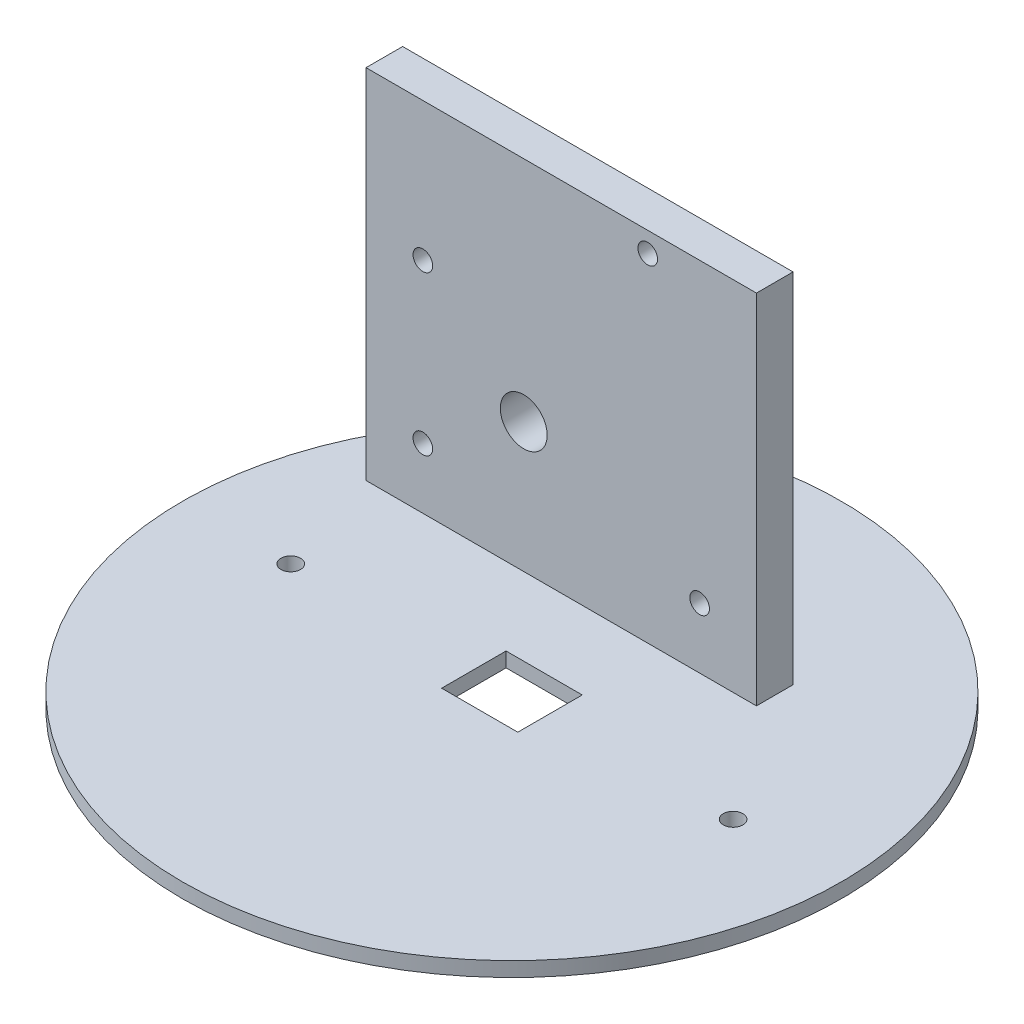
ISO-10303-21;
HEADER;
FILE_DESCRIPTION(('STEP AP214'),'2;1');
FILE_NAME('part.step','',(''),(''),'','','');
FILE_SCHEMA(('AUTOMOTIVE_DESIGN { 1 0 10303 214 1 1 1 1 }'));
ENDSEC;
DATA;
#1=APPLICATION_CONTEXT('core data for automotive mechanical design processes');
#2=APPLICATION_PROTOCOL_DEFINITION('international standard','automotive_design',2000,#1);
#3=PRODUCT_CONTEXT('',#1,'mechanical');
#4=PRODUCT('Part','Part','',(#3));
#5=PRODUCT_RELATED_PRODUCT_CATEGORY('part','',(#4));
#6=PRODUCT_DEFINITION_FORMATION('','',#4);
#7=PRODUCT_DEFINITION_CONTEXT('part definition',#1,'design');
#8=PRODUCT_DEFINITION('design','',#6,#7);
#9=PRODUCT_DEFINITION_SHAPE('','',#8);
#10=(LENGTH_UNIT() NAMED_UNIT(*) SI_UNIT(.MILLI.,.METRE.));
#11=(NAMED_UNIT(*) PLANE_ANGLE_UNIT() SI_UNIT($,.RADIAN.));
#12=(NAMED_UNIT(*) SI_UNIT($,.STERADIAN.) SOLID_ANGLE_UNIT());
#13=UNCERTAINTY_MEASURE_WITH_UNIT(LENGTH_MEASURE(1.E-05),#10,'distance_accuracy_value','');
#14=(GEOMETRIC_REPRESENTATION_CONTEXT(3) GLOBAL_UNCERTAINTY_ASSIGNED_CONTEXT((#13)) GLOBAL_UNIT_ASSIGNED_CONTEXT((#10,
#11,#12)) REPRESENTATION_CONTEXT('',''));
#15=CARTESIAN_POINT('',(0.,0.,0.));
#16=DIRECTION('',(0.,0.,1.));
#17=DIRECTION('',(1.,0.,0.));
#18=AXIS2_PLACEMENT_3D('',#15,#16,#17);
#19=CARTESIAN_POINT('',(-44.349924,64.53886,-19.05));
#20=DIRECTION('',(0.,0.,-1.));
#21=DIRECTION('',(-1.,0.,0.));
#22=AXIS2_PLACEMENT_3D('',#19,#20,#21);
#23=PLANE('',#22);
#24=CARTESIAN_POINT('',(-34.49992338,13.040000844,-19.05));
#25=DIRECTION('',(0.,0.,1.));
#26=DIRECTION('',(1.,0.,0.));
#27=AXIS2_PLACEMENT_3D('',#24,#25,#26);
#28=CIRCLE('',#27,1.69999999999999);
#29=CARTESIAN_POINT('',(-32.79992338,13.040000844,-19.05));
#30=VERTEX_POINT('',#29);
#31=EDGE_CURVE('E293',#30,#30,#28,.T.);
#32=ORIENTED_EDGE('',*,*,#31,.F.);
#33=EDGE_LOOP('',(#32));
#34=FACE_BOUND('',#33,.T.);
#35=CARTESIAN_POINT('',(-34.49992338,40.539996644,-19.05));
#36=DIRECTION('',(0.,0.,1.));
#37=DIRECTION('',(1.,0.,0.));
#38=AXIS2_PLACEMENT_3D('',#35,#36,#37);
#39=CIRCLE('',#38,1.69999999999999);
#40=CARTESIAN_POINT('',(-32.79992338,40.539996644,-19.05));
#41=VERTEX_POINT('',#40);
#42=EDGE_CURVE('E284',#41,#41,#39,.T.);
#43=ORIENTED_EDGE('',*,*,#42,.F.);
#44=EDGE_LOOP('',(#43));
#45=FACE_BOUND('',#44,.T.);
#46=CARTESIAN_POINT('',(13.49996538,13.040000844,-19.05));
#47=DIRECTION('',(0.,0.,1.));
#48=DIRECTION('',(1.,0.,0.));
#49=AXIS2_PLACEMENT_3D('',#46,#47,#48);
#50=CIRCLE('',#49,1.69999999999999);
#51=CARTESIAN_POINT('',(15.19996538,13.040000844,-19.05));
#52=VERTEX_POINT('',#51);
#53=EDGE_CURVE('E266',#52,#52,#50,.T.);
#54=ORIENTED_EDGE('',*,*,#53,.F.);
#55=EDGE_LOOP('',(#54));
#56=FACE_BOUND('',#55,.T.);
#57=CARTESIAN_POINT('',(-16.999966,25.04000072,-19.05));
#58=DIRECTION('',(0.,0.,-1.));
#59=DIRECTION('',(-1.,0.,0.));
#60=AXIS2_PLACEMENT_3D('',#57,#58,#59);
#61=CIRCLE('',#60,4.064);
#62=CARTESIAN_POINT('',(-21.063966,25.04000072,-19.05));
#63=VERTEX_POINT('',#62);
#64=EDGE_CURVE('E43',#63,#63,#61,.T.);
#65=ORIENTED_EDGE('',*,*,#64,.T.);
#66=EDGE_LOOP('',(#65));
#67=FACE_BOUND('',#66,.T.);
#68=DIRECTION('',(1.,0.,0.));
#69=VECTOR('',#68,1.);
#70=CARTESIAN_POINT('',(-44.349924,2.54,-19.05));
#71=LINE('',#70,#69);
#72=CARTESIAN_POINT('',(-44.349924,2.54,-19.05));
#73=VERTEX_POINT('',#72);
#74=CARTESIAN_POINT('',(23.349966,2.54,-19.05));
#75=VERTEX_POINT('',#74);
#76=EDGE_CURVE('E125',#73,#75,#71,.T.);
#77=ORIENTED_EDGE('',*,*,#76,.T.);
#78=DIRECTION('',(0.,-1.,0.));
#79=VECTOR('',#78,1.);
#80=CARTESIAN_POINT('',(23.349966,64.53886,-19.05));
#81=LINE('',#80,#79);
#82=CARTESIAN_POINT('',(23.349966,64.53886,-19.05));
#83=VERTEX_POINT('',#82);
#84=EDGE_CURVE('E241',#83,#75,#81,.T.);
#85=ORIENTED_EDGE('',*,*,#84,.F.);
#86=DIRECTION('',(1.,0.,0.));
#87=VECTOR('',#86,1.);
#88=CARTESIAN_POINT('',(-44.349924,64.53886,-19.05));
#89=LINE('',#88,#87);
#90=CARTESIAN_POINT('',(-44.349924,64.53886,-19.05));
#91=VERTEX_POINT('',#90);
#92=EDGE_CURVE('E121',#91,#83,#89,.T.);
#93=ORIENTED_EDGE('',*,*,#92,.F.);
#94=DIRECTION('',(0.,-1.,0.));
#95=VECTOR('',#94,1.);
#96=CARTESIAN_POINT('',(-44.349924,64.53886,-19.05));
#97=LINE('',#96,#95);
#98=EDGE_CURVE('E56',#91,#73,#97,.T.);
#99=ORIENTED_EDGE('',*,*,#98,.T.);
#100=EDGE_LOOP('',(#77,#85,#93,#99));
#101=FACE_BOUND('',#100,.T.);
#102=CARTESIAN_POINT('',(4.4999656,61.03885938,-19.05));
#103=DIRECTION('',(0.,0.,1.));
#104=DIRECTION('',(1.,0.,0.));
#105=AXIS2_PLACEMENT_3D('',#102,#103,#104);
#106=CIRCLE('',#105,1.69999999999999);
#107=CARTESIAN_POINT('',(6.19996559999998,61.03885938,-19.05));
#108=VERTEX_POINT('',#107);
#109=EDGE_CURVE('E275',#108,#108,#106,.T.);
#110=ORIENTED_EDGE('',*,*,#109,.F.);
#111=EDGE_LOOP('',(#110));
#112=FACE_BOUND('',#111,.T.);
#113=ADVANCED_FACE('F39',(#34,#45,#56,#67,#101,#112),#23,.F.);
#114=CARTESIAN_POINT('',(0.,2.54,0.));
#115=DIRECTION('',(0.,1.,0.));
#116=DIRECTION('',(0.,0.,1.));
#117=AXIS2_PLACEMENT_3D('',#114,#115,#116);
#118=PLANE('',#117);
#119=CARTESIAN_POINT('',(38.354,2.54,0.));
#120=DIRECTION('',(0.,1.,0.));
#121=DIRECTION('',(0.,0.,1.));
#122=AXIS2_PLACEMENT_3D('',#119,#120,#121);
#123=CIRCLE('',#122,1.7);
#124=CARTESIAN_POINT('',(38.354,2.54,1.69999999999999));
#125=VERTEX_POINT('',#124);
#126=EDGE_CURVE('E255',#125,#125,#123,.T.);
#127=ORIENTED_EDGE('',*,*,#126,.F.);
#128=EDGE_LOOP('',(#127));
#129=FACE_BOUND('',#128,.T.);
#130=CARTESIAN_POINT('',(-38.354,2.54,0.));
#131=DIRECTION('',(0.,1.,0.));
#132=DIRECTION('',(0.,0.,1.));
#133=AXIS2_PLACEMENT_3D('',#130,#131,#132);
#134=CIRCLE('',#133,1.7);
#135=CARTESIAN_POINT('',(-38.354,2.54,1.7));
#136=VERTEX_POINT('',#135);
#137=EDGE_CURVE('E246',#136,#136,#134,.T.);
#138=ORIENTED_EDGE('',*,*,#137,.F.);
#139=EDGE_LOOP('',(#138));
#140=FACE_BOUND('',#139,.T.);
#141=DIRECTION('',(0.,0.,-1.));
#142=VECTOR('',#141,1.);
#143=CARTESIAN_POINT('',(6.604,2.54,-5.588));
#144=LINE('',#143,#142);
#145=CARTESIAN_POINT('',(6.604,2.54,5.588));
#146=VERTEX_POINT('',#145);
#147=CARTESIAN_POINT('',(6.604,2.54,-5.588));
#148=VERTEX_POINT('',#147);
#149=EDGE_CURVE('E64',#146,#148,#144,.T.);
#150=ORIENTED_EDGE('',*,*,#149,.F.);
#151=DIRECTION('',(1.,0.,0.));
#152=VECTOR('',#151,1.);
#153=CARTESIAN_POINT('',(-6.604,2.54,5.588));
#154=LINE('',#153,#152);
#155=CARTESIAN_POINT('',(-6.604,2.54,5.588));
#156=VERTEX_POINT('',#155);
#157=EDGE_CURVE('E141',#156,#146,#154,.T.);
#158=ORIENTED_EDGE('',*,*,#157,.F.);
#159=DIRECTION('',(0.,0.,1.));
#160=VECTOR('',#159,1.);
#161=CARTESIAN_POINT('',(-6.604,2.54,-5.588));
#162=LINE('',#161,#160);
#163=CARTESIAN_POINT('',(-6.604,2.54,-5.588));
#164=VERTEX_POINT('',#163);
#165=EDGE_CURVE('E153',#164,#156,#162,.T.);
#166=ORIENTED_EDGE('',*,*,#165,.F.);
#167=DIRECTION('',(-1.,0.,0.));
#168=VECTOR('',#167,1.);
#169=CARTESIAN_POINT('',(-6.604,2.54,-5.588));
#170=LINE('',#169,#168);
#171=EDGE_CURVE('E132',#148,#164,#170,.T.);
#172=ORIENTED_EDGE('',*,*,#171,.F.);
#173=EDGE_LOOP('',(#150,#158,#166,#172));
#174=FACE_BOUND('',#173,.T.);
#175=CARTESIAN_POINT('',(0.,2.54,0.));
#176=DIRECTION('',(0.,1.,0.));
#177=DIRECTION('',(0.,0.,1.));
#178=AXIS2_PLACEMENT_3D('',#175,#176,#177);
#179=CIRCLE('',#178,57.15);
#180=CARTESIAN_POINT('',(0.,2.54,57.15));
#181=VERTEX_POINT('',#180);
#182=EDGE_CURVE('E11',#181,#181,#179,.T.);
#183=ORIENTED_EDGE('',*,*,#182,.T.);
#184=EDGE_LOOP('',(#183));
#185=FACE_BOUND('',#184,.T.);
#186=DIRECTION('',(-1.,0.,0.));
#187=VECTOR('',#186,1.);
#188=CARTESIAN_POINT('',(-44.349924,2.54,-25.4));
#189=LINE('',#188,#187);
#190=CARTESIAN_POINT('',(23.349966,2.54,-25.4));
#191=VERTEX_POINT('',#190);
#192=CARTESIAN_POINT('',(-44.349924,2.54,-25.4));
#193=VERTEX_POINT('',#192);
#194=EDGE_CURVE('E231',#191,#193,#189,.T.);
#195=ORIENTED_EDGE('',*,*,#194,.F.);
#196=DIRECTION('',(0.,0.,-1.));
#197=VECTOR('',#196,1.);
#198=CARTESIAN_POINT('',(23.349966,2.54,-25.4));
#199=LINE('',#198,#197);
#200=EDGE_CURVE('E129',#75,#191,#199,.T.);
#201=ORIENTED_EDGE('',*,*,#200,.F.);
#202=ORIENTED_EDGE('',*,*,#76,.F.);
#203=DIRECTION('',(0.,0.,1.));
#204=VECTOR('',#203,1.);
#205=CARTESIAN_POINT('',(-44.349924,2.54,-25.4));
#206=LINE('',#205,#204);
#207=EDGE_CURVE('E233',#193,#73,#206,.T.);
#208=ORIENTED_EDGE('',*,*,#207,.F.);
#209=EDGE_LOOP('',(#195,#201,#202,#208));
#210=FACE_BOUND('',#209,.T.);
#211=ADVANCED_FACE('F180',(#129,#140,#174,#185,#210),#118,.T.);
#212=CARTESIAN_POINT('',(0.,2.54,0.));
#213=DIRECTION('',(0.,-1.,0.));
#214=DIRECTION('',(0.,0.,-1.));
#215=AXIS2_PLACEMENT_3D('',#212,#213,#214);
#216=CYLINDRICAL_SURFACE('',#215,57.15);
#217=ORIENTED_EDGE('',*,*,#182,.F.);
#218=EDGE_LOOP('',(#217));
#219=FACE_BOUND('',#218,.T.);
#220=CARTESIAN_POINT('',(0.,0.,0.));
#221=DIRECTION('',(0.,1.,0.));
#222=DIRECTION('',(0.,0.,1.));
#223=AXIS2_PLACEMENT_3D('',#220,#221,#222);
#224=CIRCLE('',#223,57.15);
#225=CARTESIAN_POINT('',(0.,0.,57.15));
#226=VERTEX_POINT('',#225);
#227=EDGE_CURVE('E48',#226,#226,#224,.T.);
#228=ORIENTED_EDGE('',*,*,#227,.T.);
#229=EDGE_LOOP('',(#228));
#230=FACE_BOUND('',#229,.T.);
#231=ADVANCED_FACE('F41',(#219,#230),#216,.T.);
#232=CARTESIAN_POINT('',(0.,0.,0.));
#233=DIRECTION('',(0.,1.,0.));
#234=DIRECTION('',(0.,0.,1.));
#235=AXIS2_PLACEMENT_3D('',#232,#233,#234);
#236=PLANE('',#235);
#237=CARTESIAN_POINT('',(38.354,0.,0.));
#238=DIRECTION('',(0.,1.,0.));
#239=DIRECTION('',(0.,0.,1.));
#240=AXIS2_PLACEMENT_3D('',#237,#238,#239);
#241=CIRCLE('',#240,1.725);
#242=CARTESIAN_POINT('',(38.354,0.,1.72499999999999));
#243=VERTEX_POINT('',#242);
#244=EDGE_CURVE('E258',#243,#243,#241,.T.);
#245=ORIENTED_EDGE('',*,*,#244,.T.);
#246=EDGE_LOOP('',(#245));
#247=FACE_BOUND('',#246,.T.);
#248=CARTESIAN_POINT('',(-38.354,0.,0.));
#249=DIRECTION('',(0.,1.,0.));
#250=DIRECTION('',(0.,0.,1.));
#251=AXIS2_PLACEMENT_3D('',#248,#249,#250);
#252=CIRCLE('',#251,1.725);
#253=CARTESIAN_POINT('',(-38.354,0.,1.725));
#254=VERTEX_POINT('',#253);
#255=EDGE_CURVE('E249',#254,#254,#252,.T.);
#256=ORIENTED_EDGE('',*,*,#255,.T.);
#257=EDGE_LOOP('',(#256));
#258=FACE_BOUND('',#257,.T.);
#259=DIRECTION('',(1.,0.,0.));
#260=VECTOR('',#259,1.);
#261=CARTESIAN_POINT('',(-6.604,0.,5.588));
#262=LINE('',#261,#260);
#263=CARTESIAN_POINT('',(-6.604,0.,5.588));
#264=VERTEX_POINT('',#263);
#265=CARTESIAN_POINT('',(6.604,0.,5.588));
#266=VERTEX_POINT('',#265);
#267=EDGE_CURVE('E147',#264,#266,#262,.T.);
#268=ORIENTED_EDGE('',*,*,#267,.T.);
#269=DIRECTION('',(0.,0.,-1.));
#270=VECTOR('',#269,1.);
#271=CARTESIAN_POINT('',(6.604,0.,-5.588));
#272=LINE('',#271,#270);
#273=CARTESIAN_POINT('',(6.604,0.,-5.588));
#274=VERTEX_POINT('',#273);
#275=EDGE_CURVE('E137',#266,#274,#272,.T.);
#276=ORIENTED_EDGE('',*,*,#275,.T.);
#277=DIRECTION('',(-1.,0.,0.));
#278=VECTOR('',#277,1.);
#279=CARTESIAN_POINT('',(-6.604,0.,-5.588));
#280=LINE('',#279,#278);
#281=CARTESIAN_POINT('',(-6.604,0.,-5.588));
#282=VERTEX_POINT('',#281);
#283=EDGE_CURVE('E140',#274,#282,#280,.T.);
#284=ORIENTED_EDGE('',*,*,#283,.T.);
#285=DIRECTION('',(0.,0.,1.));
#286=VECTOR('',#285,1.);
#287=CARTESIAN_POINT('',(-6.604,0.,-5.588));
#288=LINE('',#287,#286);
#289=EDGE_CURVE('E144',#282,#264,#288,.T.);
#290=ORIENTED_EDGE('',*,*,#289,.T.);
#291=EDGE_LOOP('',(#268,#276,#284,#290));
#292=FACE_BOUND('',#291,.T.);
#293=ORIENTED_EDGE('',*,*,#227,.F.);
#294=EDGE_LOOP('',(#293));
#295=FACE_BOUND('',#294,.T.);
#296=ADVANCED_FACE('F168',(#247,#258,#292,#295),#236,.F.);
#297=CARTESIAN_POINT('',(6.604,0.,-5.588));
#298=DIRECTION('',(1.,0.,0.));
#299=DIRECTION('',(0.,0.,-1.));
#300=AXIS2_PLACEMENT_3D('',#297,#298,#299);
#301=PLANE('',#300);
#302=ORIENTED_EDGE('',*,*,#149,.T.);
#303=DIRECTION('',(0.,1.,0.));
#304=VECTOR('',#303,1.);
#305=CARTESIAN_POINT('',(6.604,0.,-5.588));
#306=LINE('',#305,#304);
#307=EDGE_CURVE('E149',#274,#148,#306,.T.);
#308=ORIENTED_EDGE('',*,*,#307,.F.);
#309=ORIENTED_EDGE('',*,*,#275,.F.);
#310=DIRECTION('',(0.,1.,0.));
#311=VECTOR('',#310,1.);
#312=CARTESIAN_POINT('',(6.604,0.,5.588));
#313=LINE('',#312,#311);
#314=EDGE_CURVE('E158',#266,#146,#313,.T.);
#315=ORIENTED_EDGE('',*,*,#314,.T.);
#316=EDGE_LOOP('',(#302,#308,#309,#315));
#317=FACE_BOUND('',#316,.T.);
#318=ADVANCED_FACE('F170',(#317),#301,.F.);
#319=CARTESIAN_POINT('',(-6.604,0.,5.588));
#320=DIRECTION('',(0.,0.,1.));
#321=DIRECTION('',(1.,0.,0.));
#322=AXIS2_PLACEMENT_3D('',#319,#320,#321);
#323=PLANE('',#322);
#324=ORIENTED_EDGE('',*,*,#157,.T.);
#325=ORIENTED_EDGE('',*,*,#314,.F.);
#326=ORIENTED_EDGE('',*,*,#267,.F.);
#327=DIRECTION('',(0.,1.,0.));
#328=VECTOR('',#327,1.);
#329=CARTESIAN_POINT('',(-6.604,0.,5.588));
#330=LINE('',#329,#328);
#331=EDGE_CURVE('E160',#264,#156,#330,.T.);
#332=ORIENTED_EDGE('',*,*,#331,.T.);
#333=EDGE_LOOP('',(#324,#325,#326,#332));
#334=FACE_BOUND('',#333,.T.);
#335=ADVANCED_FACE('F177',(#334),#323,.F.);
#336=CARTESIAN_POINT('',(-6.604,0.,-5.588));
#337=DIRECTION('',(-1.,0.,0.));
#338=DIRECTION('',(0.,0.,1.));
#339=AXIS2_PLACEMENT_3D('',#336,#337,#338);
#340=PLANE('',#339);
#341=ORIENTED_EDGE('',*,*,#165,.T.);
#342=ORIENTED_EDGE('',*,*,#331,.F.);
#343=ORIENTED_EDGE('',*,*,#289,.F.);
#344=DIRECTION('',(0.,1.,0.));
#345=VECTOR('',#344,1.);
#346=CARTESIAN_POINT('',(-6.604,0.,-5.588));
#347=LINE('',#346,#345);
#348=EDGE_CURVE('E162',#282,#164,#347,.T.);
#349=ORIENTED_EDGE('',*,*,#348,.T.);
#350=EDGE_LOOP('',(#341,#342,#343,#349));
#351=FACE_BOUND('',#350,.T.);
#352=ADVANCED_FACE('F209',(#351),#340,.F.);
#353=CARTESIAN_POINT('',(-6.604,0.,-5.588));
#354=DIRECTION('',(0.,0.,-1.));
#355=DIRECTION('',(-1.,0.,0.));
#356=AXIS2_PLACEMENT_3D('',#353,#354,#355);
#357=PLANE('',#356);
#358=ORIENTED_EDGE('',*,*,#171,.T.);
#359=ORIENTED_EDGE('',*,*,#348,.F.);
#360=ORIENTED_EDGE('',*,*,#283,.F.);
#361=ORIENTED_EDGE('',*,*,#307,.T.);
#362=EDGE_LOOP('',(#358,#359,#360,#361));
#363=FACE_BOUND('',#362,.T.);
#364=ADVANCED_FACE('F206',(#363),#357,.F.);
#365=CARTESIAN_POINT('',(23.349966,64.53886,-25.4));
#366=DIRECTION('',(-1.,0.,0.));
#367=DIRECTION('',(0.,0.,1.));
#368=AXIS2_PLACEMENT_3D('',#365,#366,#367);
#369=PLANE('',#368);
#370=ORIENTED_EDGE('',*,*,#200,.T.);
#371=DIRECTION('',(0.,-1.,0.));
#372=VECTOR('',#371,1.);
#373=CARTESIAN_POINT('',(23.349966,64.53886,-25.4));
#374=LINE('',#373,#372);
#375=CARTESIAN_POINT('',(23.349966,64.53886,-25.4));
#376=VERTEX_POINT('',#375);
#377=EDGE_CURVE('E110',#376,#191,#374,.T.);
#378=ORIENTED_EDGE('',*,*,#377,.F.);
#379=DIRECTION('',(0.,0.,-1.));
#380=VECTOR('',#379,1.);
#381=CARTESIAN_POINT('',(23.349966,64.53886,-25.4));
#382=LINE('',#381,#380);
#383=EDGE_CURVE('E117',#83,#376,#382,.T.);
#384=ORIENTED_EDGE('',*,*,#383,.F.);
#385=ORIENTED_EDGE('',*,*,#84,.T.);
#386=EDGE_LOOP('',(#370,#378,#384,#385));
#387=FACE_BOUND('',#386,.T.);
#388=ADVANCED_FACE('F127',(#387),#369,.F.);
#389=CARTESIAN_POINT('',(-44.349924,64.53886,-25.4));
#390=DIRECTION('',(0.,0.,1.));
#391=DIRECTION('',(1.,0.,0.));
#392=AXIS2_PLACEMENT_3D('',#389,#390,#391);
#393=PLANE('',#392);
#394=CARTESIAN_POINT('',(-34.49992338,13.040000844,-25.4));
#395=DIRECTION('',(0.,0.,1.));
#396=DIRECTION('',(1.,0.,0.));
#397=AXIS2_PLACEMENT_3D('',#394,#395,#396);
#398=CIRCLE('',#397,1.725);
#399=CARTESIAN_POINT('',(-32.77492338,13.040000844,-25.4));
#400=VERTEX_POINT('',#399);
#401=EDGE_CURVE('E296',#400,#400,#398,.T.);
#402=ORIENTED_EDGE('',*,*,#401,.T.);
#403=EDGE_LOOP('',(#402));
#404=FACE_BOUND('',#403,.T.);
#405=CARTESIAN_POINT('',(-34.49992338,40.539996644,-25.4));
#406=DIRECTION('',(0.,0.,1.));
#407=DIRECTION('',(1.,0.,0.));
#408=AXIS2_PLACEMENT_3D('',#405,#406,#407);
#409=CIRCLE('',#408,1.725);
#410=CARTESIAN_POINT('',(-32.77492338,40.539996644,-25.4));
#411=VERTEX_POINT('',#410);
#412=EDGE_CURVE('E287',#411,#411,#409,.T.);
#413=ORIENTED_EDGE('',*,*,#412,.T.);
#414=EDGE_LOOP('',(#413));
#415=FACE_BOUND('',#414,.T.);
#416=CARTESIAN_POINT('',(4.4999656,61.03885938,-25.4));
#417=DIRECTION('',(0.,0.,1.));
#418=DIRECTION('',(1.,0.,0.));
#419=AXIS2_PLACEMENT_3D('',#416,#417,#418);
#420=CIRCLE('',#419,1.725);
#421=CARTESIAN_POINT('',(6.22496559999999,61.03885938,-25.4));
#422=VERTEX_POINT('',#421);
#423=EDGE_CURVE('E278',#422,#422,#420,.T.);
#424=ORIENTED_EDGE('',*,*,#423,.T.);
#425=EDGE_LOOP('',(#424));
#426=FACE_BOUND('',#425,.T.);
#427=CARTESIAN_POINT('',(13.49996538,13.040000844,-25.4));
#428=DIRECTION('',(0.,0.,1.));
#429=DIRECTION('',(1.,0.,0.));
#430=AXIS2_PLACEMENT_3D('',#427,#428,#429);
#431=CIRCLE('',#430,1.725);
#432=CARTESIAN_POINT('',(15.22496538,13.040000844,-25.4));
#433=VERTEX_POINT('',#432);
#434=EDGE_CURVE('E269',#433,#433,#431,.T.);
#435=ORIENTED_EDGE('',*,*,#434,.T.);
#436=EDGE_LOOP('',(#435));
#437=FACE_BOUND('',#436,.T.);
#438=CARTESIAN_POINT('',(-16.999966,25.04000072,-25.4));
#439=DIRECTION('',(0.,0.,-1.));
#440=DIRECTION('',(-1.,0.,0.));
#441=AXIS2_PLACEMENT_3D('',#438,#439,#440);
#442=CIRCLE('',#441,4.064);
#443=CARTESIAN_POINT('',(-21.063966,25.04000072,-25.4));
#444=VERTEX_POINT('',#443);
#445=EDGE_CURVE('E260',#444,#444,#442,.T.);
#446=ORIENTED_EDGE('',*,*,#445,.F.);
#447=EDGE_LOOP('',(#446));
#448=FACE_BOUND('',#447,.T.);
#449=ORIENTED_EDGE('',*,*,#194,.T.);
#450=DIRECTION('',(0.,-1.,0.));
#451=VECTOR('',#450,1.);
#452=CARTESIAN_POINT('',(-44.349924,64.53886,-25.4));
#453=LINE('',#452,#451);
#454=CARTESIAN_POINT('',(-44.349924,64.53886,-25.4));
#455=VERTEX_POINT('',#454);
#456=EDGE_CURVE('E113',#455,#193,#453,.T.);
#457=ORIENTED_EDGE('',*,*,#456,.F.);
#458=DIRECTION('',(-1.,0.,0.));
#459=VECTOR('',#458,1.);
#460=CARTESIAN_POINT('',(-44.349924,64.53886,-25.4));
#461=LINE('',#460,#459);
#462=EDGE_CURVE('E106',#376,#455,#461,.T.);
#463=ORIENTED_EDGE('',*,*,#462,.F.);
#464=ORIENTED_EDGE('',*,*,#377,.T.);
#465=EDGE_LOOP('',(#449,#457,#463,#464));
#466=FACE_BOUND('',#465,.T.);
#467=ADVANCED_FACE('F108',(#404,#415,#426,#437,#448,#466),#393,.F.);
#468=CARTESIAN_POINT('',(-44.349924,64.53886,-25.4));
#469=DIRECTION('',(1.,0.,0.));
#470=DIRECTION('',(0.,0.,-1.));
#471=AXIS2_PLACEMENT_3D('',#468,#469,#470);
#472=PLANE('',#471);
#473=ORIENTED_EDGE('',*,*,#207,.T.);
#474=ORIENTED_EDGE('',*,*,#98,.F.);
#475=DIRECTION('',(0.,0.,1.));
#476=VECTOR('',#475,1.);
#477=CARTESIAN_POINT('',(-44.349924,64.53886,-25.4));
#478=LINE('',#477,#476);
#479=EDGE_CURVE('E116',#455,#91,#478,.T.);
#480=ORIENTED_EDGE('',*,*,#479,.F.);
#481=ORIENTED_EDGE('',*,*,#456,.T.);
#482=EDGE_LOOP('',(#473,#474,#480,#481));
#483=FACE_BOUND('',#482,.T.);
#484=ADVANCED_FACE('F198',(#483),#472,.F.);
#485=CARTESIAN_POINT('',(0.,64.53886,0.));
#486=DIRECTION('',(0.,1.,0.));
#487=DIRECTION('',(0.,0.,1.));
#488=AXIS2_PLACEMENT_3D('',#485,#486,#487);
#489=PLANE('',#488);
#490=ORIENTED_EDGE('',*,*,#383,.T.);
#491=ORIENTED_EDGE('',*,*,#462,.T.);
#492=ORIENTED_EDGE('',*,*,#479,.T.);
#493=ORIENTED_EDGE('',*,*,#92,.T.);
#494=EDGE_LOOP('',(#490,#491,#492,#493));
#495=FACE_BOUND('',#494,.T.);
#496=ADVANCED_FACE('F120',(#495),#489,.T.);
#497=CARTESIAN_POINT('',(-38.354,0.0250000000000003,0.));
#498=DIRECTION('',(0.,-1.,0.));
#499=DIRECTION('',(0.,0.,-1.));
#500=AXIS2_PLACEMENT_3D('',#497,#498,#499);
#501=CONICAL_SURFACE('',#500,1.7,0.785398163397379);
#502=ORIENTED_EDGE('',*,*,#255,.F.);
#503=EDGE_LOOP('',(#502));
#504=FACE_BOUND('',#503,.T.);
#505=CARTESIAN_POINT('',(-38.354,0.0250000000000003,0.));
#506=DIRECTION('',(0.,1.,0.));
#507=DIRECTION('',(0.,0.,1.));
#508=AXIS2_PLACEMENT_3D('',#505,#506,#507);
#509=CIRCLE('',#508,1.7);
#510=CARTESIAN_POINT('',(-38.354,0.0250000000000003,1.7));
#511=VERTEX_POINT('',#510);
#512=EDGE_CURVE('E236',#511,#511,#509,.T.);
#513=ORIENTED_EDGE('',*,*,#512,.T.);
#514=EDGE_LOOP('',(#513));
#515=FACE_BOUND('',#514,.T.);
#516=ADVANCED_FACE('F351',(#504,#515),#501,.F.);
#517=CARTESIAN_POINT('',(-38.354,2.54,0.));
#518=DIRECTION('',(0.,1.,0.));
#519=DIRECTION('',(0.,0.,1.));
#520=AXIS2_PLACEMENT_3D('',#517,#518,#519);
#521=CYLINDRICAL_SURFACE('',#520,1.7);
#522=ORIENTED_EDGE('',*,*,#512,.F.);
#523=EDGE_LOOP('',(#522));
#524=FACE_BOUND('',#523,.T.);
#525=ORIENTED_EDGE('',*,*,#137,.T.);
#526=EDGE_LOOP('',(#525));
#527=FACE_BOUND('',#526,.T.);
#528=ADVANCED_FACE('F348',(#524,#527),#521,.F.);
#529=CARTESIAN_POINT('',(38.354,0.0250000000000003,0.));
#530=DIRECTION('',(0.,-1.,0.));
#531=DIRECTION('',(0.,0.,-1.));
#532=AXIS2_PLACEMENT_3D('',#529,#530,#531);
#533=CONICAL_SURFACE('',#532,1.7,0.785398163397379);
#534=ORIENTED_EDGE('',*,*,#244,.F.);
#535=EDGE_LOOP('',(#534));
#536=FACE_BOUND('',#535,.T.);
#537=CARTESIAN_POINT('',(38.354,0.0250000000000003,0.));
#538=DIRECTION('',(0.,1.,0.));
#539=DIRECTION('',(0.,0.,1.));
#540=AXIS2_PLACEMENT_3D('',#537,#538,#539);
#541=CIRCLE('',#540,1.7);
#542=CARTESIAN_POINT('',(38.354,0.0250000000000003,1.69999999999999));
#543=VERTEX_POINT('',#542);
#544=EDGE_CURVE('E252',#543,#543,#541,.T.);
#545=ORIENTED_EDGE('',*,*,#544,.T.);
#546=EDGE_LOOP('',(#545));
#547=FACE_BOUND('',#546,.T.);
#548=ADVANCED_FACE('F344',(#536,#547),#533,.F.);
#549=CARTESIAN_POINT('',(38.354,2.54,0.));
#550=DIRECTION('',(0.,1.,0.));
#551=DIRECTION('',(0.,0.,1.));
#552=AXIS2_PLACEMENT_3D('',#549,#550,#551);
#553=CYLINDRICAL_SURFACE('',#552,1.7);
#554=ORIENTED_EDGE('',*,*,#544,.F.);
#555=EDGE_LOOP('',(#554));
#556=FACE_BOUND('',#555,.T.);
#557=ORIENTED_EDGE('',*,*,#126,.T.);
#558=EDGE_LOOP('',(#557));
#559=FACE_BOUND('',#558,.T.);
#560=ADVANCED_FACE('F340',(#556,#559),#553,.F.);
#561=CARTESIAN_POINT('',(-16.999966,25.04000072,57.15));
#562=DIRECTION('',(0.,0.,-1.));
#563=DIRECTION('',(-1.,0.,0.));
#564=AXIS2_PLACEMENT_3D('',#561,#562,#563);
#565=CYLINDRICAL_SURFACE('',#564,4.064);
#566=ORIENTED_EDGE('',*,*,#445,.T.);
#567=EDGE_LOOP('',(#566));
#568=FACE_BOUND('',#567,.T.);
#569=ORIENTED_EDGE('',*,*,#64,.F.);
#570=EDGE_LOOP('',(#569));
#571=FACE_BOUND('',#570,.T.);
#572=ADVANCED_FACE('F337',(#568,#571),#565,.F.);
#573=CARTESIAN_POINT('',(13.49996538,13.040000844,-25.375));
#574=DIRECTION('',(0.,0.,-1.));
#575=DIRECTION('',(-1.,0.,0.));
#576=AXIS2_PLACEMENT_3D('',#573,#574,#575);
#577=CONICAL_SURFACE('',#576,1.7,0.785398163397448);
#578=ORIENTED_EDGE('',*,*,#434,.F.);
#579=EDGE_LOOP('',(#578));
#580=FACE_BOUND('',#579,.T.);
#581=CARTESIAN_POINT('',(13.49996538,13.040000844,-25.375));
#582=DIRECTION('',(0.,0.,1.));
#583=DIRECTION('',(1.,0.,0.));
#584=AXIS2_PLACEMENT_3D('',#581,#582,#583);
#585=CIRCLE('',#584,1.7);
#586=CARTESIAN_POINT('',(15.19996538,13.040000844,-25.375));
#587=VERTEX_POINT('',#586);
#588=EDGE_CURVE('E263',#587,#587,#585,.T.);
#589=ORIENTED_EDGE('',*,*,#588,.T.);
#590=EDGE_LOOP('',(#589));
#591=FACE_BOUND('',#590,.T.);
#592=ADVANCED_FACE('F333',(#580,#591),#577,.F.);
#593=CARTESIAN_POINT('',(13.49996538,13.040000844,-19.05));
#594=DIRECTION('',(0.,0.,1.));
#595=DIRECTION('',(1.,0.,0.));
#596=AXIS2_PLACEMENT_3D('',#593,#594,#595);
#597=CYLINDRICAL_SURFACE('',#596,1.69999999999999);
#598=ORIENTED_EDGE('',*,*,#588,.F.);
#599=EDGE_LOOP('',(#598));
#600=FACE_BOUND('',#599,.T.);
#601=ORIENTED_EDGE('',*,*,#53,.T.);
#602=EDGE_LOOP('',(#601));
#603=FACE_BOUND('',#602,.T.);
#604=ADVANCED_FACE('F329',(#600,#603),#597,.F.);
#605=CARTESIAN_POINT('',(4.4999656,61.03885938,-25.375));
#606=DIRECTION('',(0.,0.,-1.));
#607=DIRECTION('',(-1.,0.,0.));
#608=AXIS2_PLACEMENT_3D('',#605,#606,#607);
#609=CONICAL_SURFACE('',#608,1.7,0.785398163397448);
#610=ORIENTED_EDGE('',*,*,#423,.F.);
#611=EDGE_LOOP('',(#610));
#612=FACE_BOUND('',#611,.T.);
#613=CARTESIAN_POINT('',(4.4999656,61.03885938,-25.375));
#614=DIRECTION('',(0.,0.,1.));
#615=DIRECTION('',(1.,0.,0.));
#616=AXIS2_PLACEMENT_3D('',#613,#614,#615);
#617=CIRCLE('',#616,1.7);
#618=CARTESIAN_POINT('',(6.19996559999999,61.03885938,-25.375));
#619=VERTEX_POINT('',#618);
#620=EDGE_CURVE('E272',#619,#619,#617,.T.);
#621=ORIENTED_EDGE('',*,*,#620,.T.);
#622=EDGE_LOOP('',(#621));
#623=FACE_BOUND('',#622,.T.);
#624=ADVANCED_FACE('F325',(#612,#623),#609,.F.);
#625=CARTESIAN_POINT('',(4.4999656,61.03885938,-19.05));
#626=DIRECTION('',(0.,0.,1.));
#627=DIRECTION('',(1.,0.,0.));
#628=AXIS2_PLACEMENT_3D('',#625,#626,#627);
#629=CYLINDRICAL_SURFACE('',#628,1.69999999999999);
#630=ORIENTED_EDGE('',*,*,#620,.F.);
#631=EDGE_LOOP('',(#630));
#632=FACE_BOUND('',#631,.T.);
#633=ORIENTED_EDGE('',*,*,#109,.T.);
#634=EDGE_LOOP('',(#633));
#635=FACE_BOUND('',#634,.T.);
#636=ADVANCED_FACE('F321',(#632,#635),#629,.F.);
#637=CARTESIAN_POINT('',(-34.49992338,40.539996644,-25.375));
#638=DIRECTION('',(0.,0.,-1.));
#639=DIRECTION('',(-1.,0.,0.));
#640=AXIS2_PLACEMENT_3D('',#637,#638,#639);
#641=CONICAL_SURFACE('',#640,1.7,0.785398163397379);
#642=ORIENTED_EDGE('',*,*,#412,.F.);
#643=EDGE_LOOP('',(#642));
#644=FACE_BOUND('',#643,.T.);
#645=CARTESIAN_POINT('',(-34.49992338,40.539996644,-25.375));
#646=DIRECTION('',(0.,0.,1.));
#647=DIRECTION('',(1.,0.,0.));
#648=AXIS2_PLACEMENT_3D('',#645,#646,#647);
#649=CIRCLE('',#648,1.7);
#650=CARTESIAN_POINT('',(-32.79992338,40.539996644,-25.375));
#651=VERTEX_POINT('',#650);
#652=EDGE_CURVE('E281',#651,#651,#649,.T.);
#653=ORIENTED_EDGE('',*,*,#652,.T.);
#654=EDGE_LOOP('',(#653));
#655=FACE_BOUND('',#654,.T.);
#656=ADVANCED_FACE('F317',(#644,#655),#641,.F.);
#657=CARTESIAN_POINT('',(-34.49992338,40.539996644,-19.05));
#658=DIRECTION('',(0.,0.,1.));
#659=DIRECTION('',(1.,0.,0.));
#660=AXIS2_PLACEMENT_3D('',#657,#658,#659);
#661=CYLINDRICAL_SURFACE('',#660,1.69999999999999);
#662=ORIENTED_EDGE('',*,*,#652,.F.);
#663=EDGE_LOOP('',(#662));
#664=FACE_BOUND('',#663,.T.);
#665=ORIENTED_EDGE('',*,*,#42,.T.);
#666=EDGE_LOOP('',(#665));
#667=FACE_BOUND('',#666,.T.);
#668=ADVANCED_FACE('F305',(#664,#667),#661,.F.);
#669=CARTESIAN_POINT('',(-34.49992338,13.040000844,-25.375));
#670=DIRECTION('',(0.,0.,-1.));
#671=DIRECTION('',(-1.,0.,0.));
#672=AXIS2_PLACEMENT_3D('',#669,#670,#671);
#673=CONICAL_SURFACE('',#672,1.7,0.785398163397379);
#674=ORIENTED_EDGE('',*,*,#401,.F.);
#675=EDGE_LOOP('',(#674));
#676=FACE_BOUND('',#675,.T.);
#677=CARTESIAN_POINT('',(-34.49992338,13.040000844,-25.375));
#678=DIRECTION('',(0.,0.,1.));
#679=DIRECTION('',(1.,0.,0.));
#680=AXIS2_PLACEMENT_3D('',#677,#678,#679);
#681=CIRCLE('',#680,1.7);
#682=CARTESIAN_POINT('',(-32.79992338,13.040000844,-25.375));
#683=VERTEX_POINT('',#682);
#684=EDGE_CURVE('E290',#683,#683,#681,.T.);
#685=ORIENTED_EDGE('',*,*,#684,.T.);
#686=EDGE_LOOP('',(#685));
#687=FACE_BOUND('',#686,.T.);
#688=ADVANCED_FACE('F301',(#676,#687),#673,.F.);
#689=CARTESIAN_POINT('',(-34.49992338,13.040000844,-19.05));
#690=DIRECTION('',(0.,0.,1.));
#691=DIRECTION('',(1.,0.,0.));
#692=AXIS2_PLACEMENT_3D('',#689,#690,#691);
#693=CYLINDRICAL_SURFACE('',#692,1.69999999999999);
#694=ORIENTED_EDGE('',*,*,#684,.F.);
#695=EDGE_LOOP('',(#694));
#696=FACE_BOUND('',#695,.T.);
#697=ORIENTED_EDGE('',*,*,#31,.T.);
#698=EDGE_LOOP('',(#697));
#699=FACE_BOUND('',#698,.T.);
#700=ADVANCED_FACE('F304',(#696,#699),#693,.F.);
#701=CLOSED_SHELL('',(#113,#211,#231,#296,#318,#335,#352,#364,#388,#467,#484,#496,#516,#528,
#548,#560,#572,#592,#604,#624,#636,#656,#668,#688,#700));
#702=MANIFOLD_SOLID_BREP('B2',#701);
#703=ADVANCED_BREP_SHAPE_REPRESENTATION('',(#18,#702),#14);
#704=SHAPE_DEFINITION_REPRESENTATION(#9,#703);
ENDSEC;
END-ISO-10303-21;
